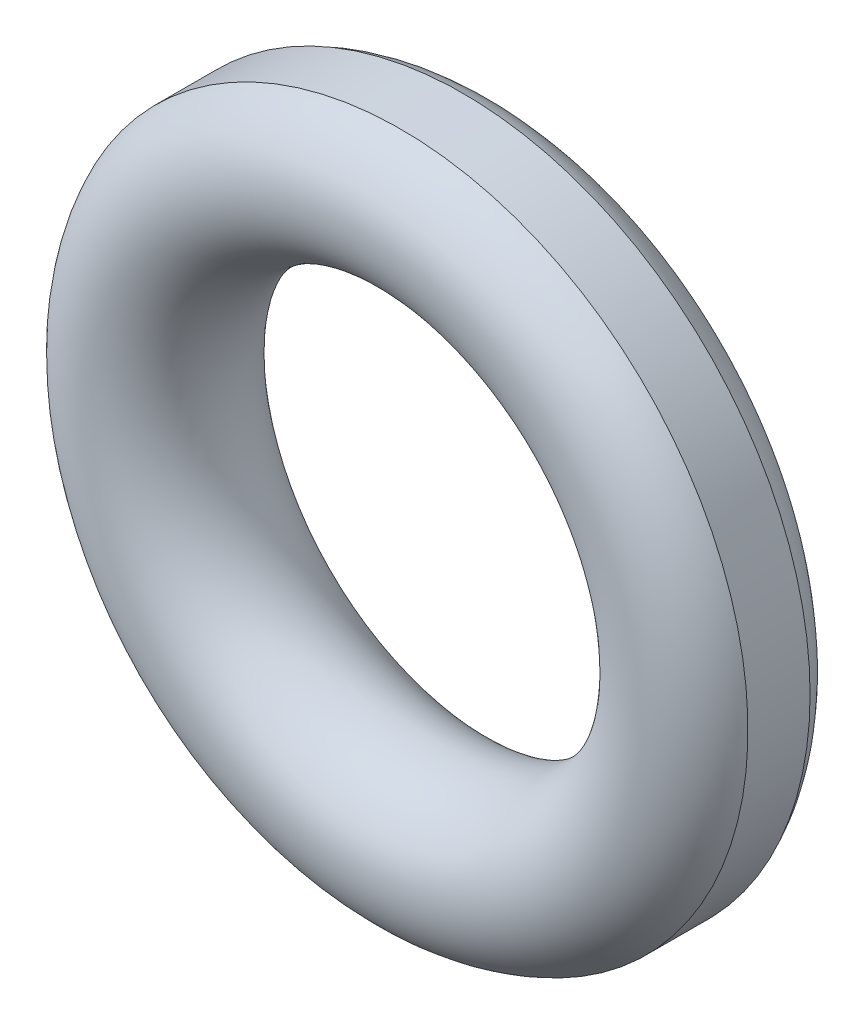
ISO-10303-21;
HEADER;
FILE_DESCRIPTION(('STEP AP214'),'2;1');
FILE_NAME('part.step','',(''),(''),'','','');
FILE_SCHEMA(('AUTOMOTIVE_DESIGN { 1 0 10303 214 1 1 1 1 }'));
ENDSEC;
DATA;
#1=APPLICATION_CONTEXT('core data for automotive mechanical design processes');
#2=APPLICATION_PROTOCOL_DEFINITION('international standard','automotive_design',2000,#1);
#3=PRODUCT_CONTEXT('',#1,'mechanical');
#4=PRODUCT('Part','Part','',(#3));
#5=PRODUCT_RELATED_PRODUCT_CATEGORY('part','',(#4));
#6=PRODUCT_DEFINITION_FORMATION('','',#4);
#7=PRODUCT_DEFINITION_CONTEXT('part definition',#1,'design');
#8=PRODUCT_DEFINITION('design','',#6,#7);
#9=PRODUCT_DEFINITION_SHAPE('','',#8);
#10=(LENGTH_UNIT() NAMED_UNIT(*) SI_UNIT(.MILLI.,.METRE.));
#11=(NAMED_UNIT(*) PLANE_ANGLE_UNIT() SI_UNIT($,.RADIAN.));
#12=(NAMED_UNIT(*) SI_UNIT($,.STERADIAN.) SOLID_ANGLE_UNIT());
#13=UNCERTAINTY_MEASURE_WITH_UNIT(LENGTH_MEASURE(1.E-05),#10,'distance_accuracy_value','');
#14=(GEOMETRIC_REPRESENTATION_CONTEXT(3) GLOBAL_UNCERTAINTY_ASSIGNED_CONTEXT((#13)) GLOBAL_UNIT_ASSIGNED_CONTEXT((#10,
#11,#12)) REPRESENTATION_CONTEXT('',''));
#15=CARTESIAN_POINT('',(0.,0.,0.));
#16=DIRECTION('',(0.,0.,1.));
#17=DIRECTION('',(1.,0.,0.));
#18=AXIS2_PLACEMENT_3D('',#15,#16,#17);
#19=CARTESIAN_POINT('',(0.,0.,0.));
#20=DIRECTION('',(0.,0.,-1.));
#21=DIRECTION('',(-1.,0.,0.));
#22=AXIS2_PLACEMENT_3D('',#19,#20,#21);
#23=TOROIDAL_SURFACE('',#22,4.225,1.175);
#24=CARTESIAN_POINT('',(0.,0.,0.474341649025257));
#25=DIRECTION('',(0.,0.,-1.));
#26=DIRECTION('',(-1.,0.,0.));
#27=AXIS2_PLACEMENT_3D('',#24,#25,#26);
#28=CIRCLE('',#27,5.3);
#29=CARTESIAN_POINT('',(-5.3,0.,0.474341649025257));
#30=VERTEX_POINT('',#29);
#31=EDGE_CURVE('E39',#30,#30,#28,.F.);
#32=ORIENTED_EDGE('',*,*,#31,.T.);
#33=EDGE_LOOP('',(#32));
#34=FACE_BOUND('',#33,.T.);
#35=CARTESIAN_POINT('',(0.,0.,-0.474341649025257));
#36=DIRECTION('',(0.,0.,1.));
#37=DIRECTION('',(1.,0.,0.));
#38=AXIS2_PLACEMENT_3D('',#35,#36,#37);
#39=CIRCLE('',#38,5.3);
#40=CARTESIAN_POINT('',(5.3,0.,-0.474341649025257));
#41=VERTEX_POINT('',#40);
#42=EDGE_CURVE('E11',#41,#41,#39,.F.);
#43=ORIENTED_EDGE('',*,*,#42,.T.);
#44=EDGE_LOOP('',(#43));
#45=FACE_BOUND('',#44,.T.);
#46=ADVANCED_FACE('F33',(#34,#45),#23,.T.);
#47=CARTESIAN_POINT('',(0.,0.,-1.175));
#48=DIRECTION('',(0.,0.,1.));
#49=DIRECTION('',(1.,0.,0.));
#50=AXIS2_PLACEMENT_3D('',#47,#48,#49);
#51=CYLINDRICAL_SURFACE('',#50,5.3);
#52=ORIENTED_EDGE('',*,*,#42,.F.);
#53=EDGE_LOOP('',(#52));
#54=FACE_BOUND('',#53,.T.);
#55=ORIENTED_EDGE('',*,*,#31,.F.);
#56=EDGE_LOOP('',(#55));
#57=FACE_BOUND('',#56,.T.);
#58=ADVANCED_FACE('F46',(#54,#57),#51,.T.);
#59=CLOSED_SHELL('',(#46,#58));
#60=MANIFOLD_SOLID_BREP('B2',#59);
#61=ADVANCED_BREP_SHAPE_REPRESENTATION('',(#18,#60),#14);
#62=SHAPE_DEFINITION_REPRESENTATION(#9,#61);
ENDSEC;
END-ISO-10303-21;
